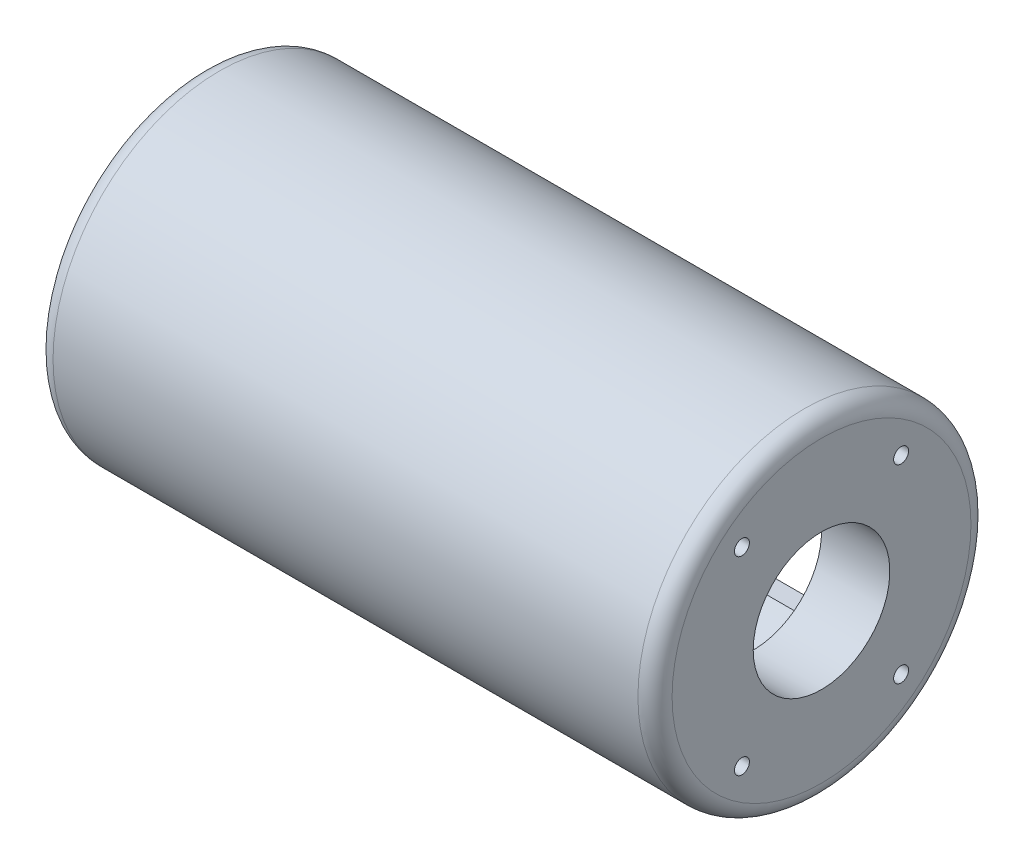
from build123d import *

# Parameters (mm, degrees)
CONG_1_R                = 4
ESQUISSE2_R             = 1.75
ENL_V_MAT_EXTRU_1_DEPTH = 20
ENL_V_MAT_EXTRU_2_DEPTH = 150


with BuildPart() as part:
    # Esquisse1 → Base-R_volution (revolve)
    with BuildSketch(Plane.XY, mode=Mode.PRIVATE) as base_r_volution_sk:
        Polygon((0, 6.5), (0, 39), (145, 39), (145, 16), (129, 16), (129, 36), (16, 36), (16, 6.5), align=None)
    revolve(base_r_volution_sk.sketch.rotate(Axis((0, 0, 0), (1, 0, 0)), 90), axis=Axis((0, 0, 0), (1, 0, 0)))

    # Cong_1
    cong_1_edges = [part.edges().sort_by_distance(p)[0] for p in [
        (0, 0, -39),
        (145, 0, -39),
    ]]
    fillet(cong_1_edges, radius=CONG_1_R)

    # Esquisse2 → Enl_v. mat.-Extru.1 (cut)
    with BuildSketch(Plane(origin=(145, 0, 0), x_dir=(0, 0, -1), z_dir=(1, 0, 0))):
        with Locations((18.640840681, 22.21528885)):
            Circle(ESQUISSE2_R)
        with Locations((-18.640840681, 22.21528885)):
            Circle(ESQUISSE2_R)
        with Locations((18.640840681, -22.21528885)):
            Circle(ESQUISSE2_R)
        with Locations((-18.640840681, -22.21528885)):
            Circle(ESQUISSE2_R)
    extrude(amount=-ENL_V_MAT_EXTRU_1_DEPTH, mode=Mode.SUBTRACT)

    # Esquisse3 → Enl_v. mat.-Extru.2 (cut)
    with BuildSketch(Plane.XY):
        with BuildLine():
            Line((20, 27), (124.87214558, 27))
            ThreePointArc((124.87214558, 27), (126.993465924, 26.121320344), (127.87214558, 24))
            Line((127.87214558, 24), (127.87214558, -24))
            ThreePointArc((127.87214558, -24), (126.993465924, -26.121320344), (124.87214558, -27))
            Line((124.87214558, -27), (20, -27))
            ThreePointArc((20, -27), (17.878679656, -26.121320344), (17, -24))
            Line((17, -24), (17, 24))
            ThreePointArc((17, 24), (17.878679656, 26.121320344), (20, 27))
        make_face()
    extrude(amount=-ENL_V_MAT_EXTRU_2_DEPTH, mode=Mode.SUBTRACT)


solid = part.part
